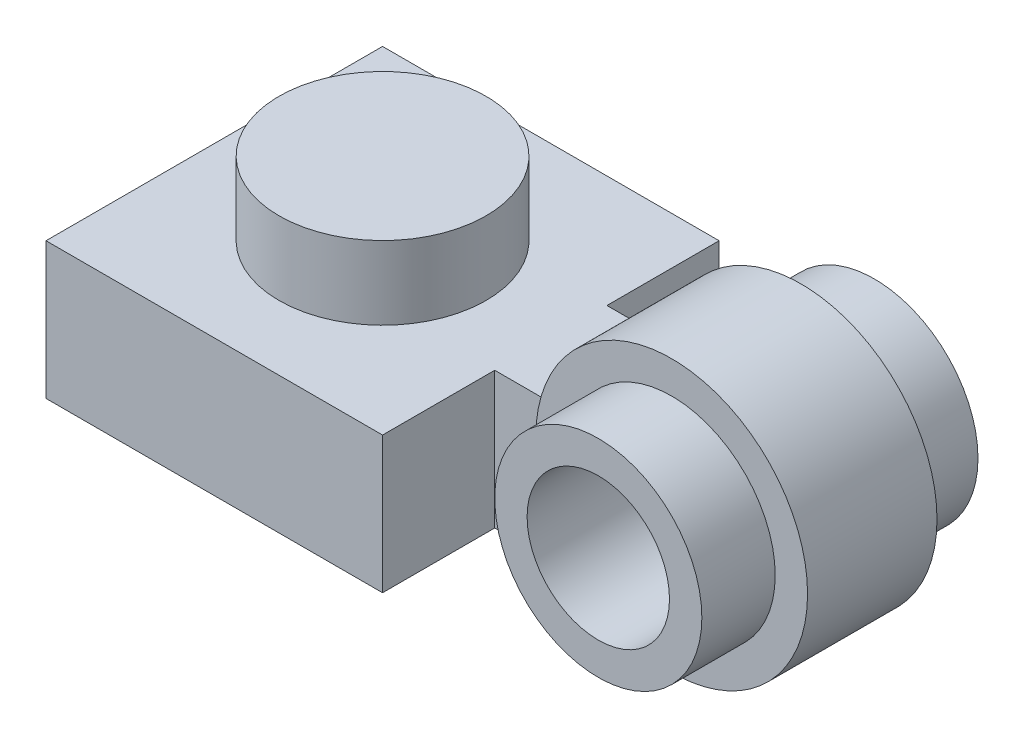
ISO-10303-21;
HEADER;
FILE_DESCRIPTION(('STEP AP214'),'2;1');
FILE_NAME('part.step','',(''),(''),'','','');
FILE_SCHEMA(('AUTOMOTIVE_DESIGN { 1 0 10303 214 1 1 1 1 }'));
ENDSEC;
DATA;
#1=APPLICATION_CONTEXT('core data for automotive mechanical design processes');
#2=APPLICATION_PROTOCOL_DEFINITION('international standard','automotive_design',2000,#1);
#3=PRODUCT_CONTEXT('',#1,'mechanical');
#4=PRODUCT('Part','Part','',(#3));
#5=PRODUCT_RELATED_PRODUCT_CATEGORY('part','',(#4));
#6=PRODUCT_DEFINITION_FORMATION('','',#4);
#7=PRODUCT_DEFINITION_CONTEXT('part definition',#1,'design');
#8=PRODUCT_DEFINITION('design','',#6,#7);
#9=PRODUCT_DEFINITION_SHAPE('','',#8);
#10=(LENGTH_UNIT() NAMED_UNIT(*) SI_UNIT(.MILLI.,.METRE.));
#11=(NAMED_UNIT(*) PLANE_ANGLE_UNIT() SI_UNIT($,.RADIAN.));
#12=(NAMED_UNIT(*) SI_UNIT($,.STERADIAN.) SOLID_ANGLE_UNIT());
#13=UNCERTAINTY_MEASURE_WITH_UNIT(LENGTH_MEASURE(1.E-05),#10,'distance_accuracy_value','');
#14=(GEOMETRIC_REPRESENTATION_CONTEXT(3) GLOBAL_UNCERTAINTY_ASSIGNED_CONTEXT((#13)) GLOBAL_UNIT_ASSIGNED_CONTEXT((#10,
#11,#12)) REPRESENTATION_CONTEXT('',''));
#15=CARTESIAN_POINT('',(0.,0.,0.));
#16=DIRECTION('',(0.,0.,1.));
#17=DIRECTION('',(1.,0.,0.));
#18=AXIS2_PLACEMENT_3D('',#15,#16,#17);
#19=CARTESIAN_POINT('',(8.2,2.5,-1.5));
#20=DIRECTION('',(0.,0.,1.));
#21=DIRECTION('',(1.,0.,0.));
#22=AXIS2_PLACEMENT_3D('',#19,#20,#21);
#23=PLANE('',#22);
#24=CARTESIAN_POINT('',(8.2,2.5,-1.5));
#25=DIRECTION('',(0.,0.,1.));
#26=DIRECTION('',(1.,0.,0.));
#27=AXIS2_PLACEMENT_3D('',#24,#25,#26);
#28=CIRCLE('',#27,3.15);
#29=CARTESIAN_POINT('',(11.35,2.5,-1.5));
#30=VERTEX_POINT('',#29);
#31=EDGE_CURVE('E508',#30,#30,#28,.T.);
#32=ORIENTED_EDGE('',*,*,#31,.F.);
#33=EDGE_LOOP('',(#32));
#34=FACE_BOUND('',#33,.T.);
#35=CARTESIAN_POINT('',(8.2,2.5,-1.5));
#36=DIRECTION('',(0.,0.,1.));
#37=DIRECTION('',(1.,0.,0.));
#38=AXIS2_PLACEMENT_3D('',#35,#36,#37);
#39=CIRCLE('',#38,2.4);
#40=CARTESIAN_POINT('',(10.6,2.5,-1.5));
#41=VERTEX_POINT('',#40);
#42=EDGE_CURVE('E11',#41,#41,#39,.F.);
#43=ORIENTED_EDGE('',*,*,#42,.F.);
#44=EDGE_LOOP('',(#43));
#45=FACE_BOUND('',#44,.T.);
#46=ADVANCED_FACE('F39',(#34,#45),#23,.F.);
#47=CARTESIAN_POINT('',(8.2,2.5,1.5));
#48=DIRECTION('',(0.,0.,1.));
#49=DIRECTION('',(1.,0.,0.));
#50=AXIS2_PLACEMENT_3D('',#47,#48,#49);
#51=PLANE('',#50);
#52=CARTESIAN_POINT('',(8.2,2.5,1.5));
#53=DIRECTION('',(0.,0.,1.));
#54=DIRECTION('',(1.,0.,0.));
#55=AXIS2_PLACEMENT_3D('',#52,#53,#54);
#56=CIRCLE('',#55,3.15);
#57=CARTESIAN_POINT('',(11.35,2.5,1.5));
#58=VERTEX_POINT('',#57);
#59=EDGE_CURVE('E511',#58,#58,#56,.T.);
#60=ORIENTED_EDGE('',*,*,#59,.T.);
#61=EDGE_LOOP('',(#60));
#62=FACE_BOUND('',#61,.T.);
#63=CARTESIAN_POINT('',(8.2,2.5,1.5));
#64=DIRECTION('',(0.,0.,1.));
#65=DIRECTION('',(1.,0.,0.));
#66=AXIS2_PLACEMENT_3D('',#63,#64,#65);
#67=CIRCLE('',#66,2.4);
#68=CARTESIAN_POINT('',(10.6,2.5,1.5));
#69=VERTEX_POINT('',#68);
#70=EDGE_CURVE('E504',#69,#69,#67,.T.);
#71=ORIENTED_EDGE('',*,*,#70,.F.);
#72=EDGE_LOOP('',(#71));
#73=FACE_BOUND('',#72,.T.);
#74=ADVANCED_FACE('F277',(#62,#73),#51,.T.);
#75=CARTESIAN_POINT('',(-3.9,3.166,-3.9));
#76=DIRECTION('',(0.,1.,0.));
#77=DIRECTION('',(0.,0.,1.));
#78=AXIS2_PLACEMENT_3D('',#75,#76,#77);
#79=PLANE('',#78);
#80=CARTESIAN_POINT('',(0.,3.166,0.));
#81=DIRECTION('',(0.,1.,0.));
#82=DIRECTION('',(0.,0.,1.));
#83=AXIS2_PLACEMENT_3D('',#80,#81,#82);
#84=CIRCLE('',#83,2.4);
#85=CARTESIAN_POINT('',(0.,3.166,2.4));
#86=VERTEX_POINT('',#85);
#87=EDGE_CURVE('E201',#86,#86,#84,.T.);
#88=ORIENTED_EDGE('',*,*,#87,.F.);
#89=EDGE_LOOP('',(#88));
#90=FACE_BOUND('',#89,.T.);
#91=DIRECTION('',(-1.,0.,0.));
#92=VECTOR('',#91,1.);
#93=CARTESIAN_POINT('',(10.7,3.166,1.3));
#94=LINE('',#93,#92);
#95=CARTESIAN_POINT('',(5.12121062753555,3.166,1.3));
#96=VERTEX_POINT('',#95);
#97=CARTESIAN_POINT('',(3.9,3.166,1.3));
#98=VERTEX_POINT('',#97);
#99=EDGE_CURVE('E137',#96,#98,#94,.T.);
#100=ORIENTED_EDGE('',*,*,#99,.F.);
#101=DIRECTION('',(0.,0.,-1.));
#102=VECTOR('',#101,1.);
#103=CARTESIAN_POINT('',(5.12121062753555,3.166,1.5));
#104=LINE('',#103,#102);
#105=CARTESIAN_POINT('',(5.12121062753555,3.166,-1.3));
#106=VERTEX_POINT('',#105);
#107=EDGE_CURVE('E140',#96,#106,#104,.T.);
#108=ORIENTED_EDGE('',*,*,#107,.T.);
#109=DIRECTION('',(-1.,0.,0.));
#110=VECTOR('',#109,1.);
#111=CARTESIAN_POINT('',(10.7,3.166,-1.3));
#112=LINE('',#111,#110);
#113=CARTESIAN_POINT('',(3.9,3.166,-1.3));
#114=VERTEX_POINT('',#113);
#115=EDGE_CURVE('E128',#106,#114,#112,.T.);
#116=ORIENTED_EDGE('',*,*,#115,.T.);
#117=DIRECTION('',(0.,0.,-1.));
#118=VECTOR('',#117,1.);
#119=CARTESIAN_POINT('',(3.9,3.166,3.9));
#120=LINE('',#119,#118);
#121=CARTESIAN_POINT('',(3.9,3.166,-3.9));
#122=VERTEX_POINT('',#121);
#123=EDGE_CURVE('E168',#114,#122,#120,.T.);
#124=ORIENTED_EDGE('',*,*,#123,.T.);
#125=DIRECTION('',(-1.,0.,0.));
#126=VECTOR('',#125,1.);
#127=CARTESIAN_POINT('',(3.9,3.166,-3.9));
#128=LINE('',#127,#126);
#129=CARTESIAN_POINT('',(-3.9,3.166,-3.9));
#130=VERTEX_POINT('',#129);
#131=EDGE_CURVE('E221',#122,#130,#128,.T.);
#132=ORIENTED_EDGE('',*,*,#131,.T.);
#133=DIRECTION('',(0.,0.,1.));
#134=VECTOR('',#133,1.);
#135=CARTESIAN_POINT('',(-3.9,3.166,3.9));
#136=LINE('',#135,#134);
#137=CARTESIAN_POINT('',(-3.9,3.166,3.9));
#138=VERTEX_POINT('',#137);
#139=EDGE_CURVE('E214',#130,#138,#136,.T.);
#140=ORIENTED_EDGE('',*,*,#139,.T.);
#141=DIRECTION('',(1.,0.,0.));
#142=VECTOR('',#141,1.);
#143=CARTESIAN_POINT('',(3.9,3.166,3.9));
#144=LINE('',#143,#142);
#145=CARTESIAN_POINT('',(3.9,3.166,3.9));
#146=VERTEX_POINT('',#145);
#147=EDGE_CURVE('E217',#138,#146,#144,.T.);
#148=ORIENTED_EDGE('',*,*,#147,.T.);
#149=EDGE_CURVE('E224',#146,#98,#120,.T.);
#150=ORIENTED_EDGE('',*,*,#149,.T.);
#151=EDGE_LOOP('',(#100,#108,#116,#124,#132,#140,#148,#150));
#152=FACE_BOUND('',#151,.T.);
#153=ADVANCED_FACE('F141',(#90,#152),#79,.T.);
#154=CARTESIAN_POINT('',(-3.9,0.,-3.9));
#155=DIRECTION('',(0.,1.,0.));
#156=DIRECTION('',(0.,0.,1.));
#157=AXIS2_PLACEMENT_3D('',#154,#155,#156);
#158=PLANE('',#157);
#159=DIRECTION('',(1.,0.,0.));
#160=VECTOR('',#159,1.);
#161=CARTESIAN_POINT('',(2.45,0.,-2.45));
#162=LINE('',#161,#160);
#163=CARTESIAN_POINT('',(-2.45,0.,-2.45));
#164=VERTEX_POINT('',#163);
#165=CARTESIAN_POINT('',(2.45,0.,-2.45));
#166=VERTEX_POINT('',#165);
#167=EDGE_CURVE('E191',#164,#166,#162,.T.);
#168=ORIENTED_EDGE('',*,*,#167,.F.);
#169=DIRECTION('',(0.,0.,-1.));
#170=VECTOR('',#169,1.);
#171=CARTESIAN_POINT('',(-2.45,0.,-2.45));
#172=LINE('',#171,#170);
#173=CARTESIAN_POINT('',(-2.45,0.,2.45));
#174=VERTEX_POINT('',#173);
#175=EDGE_CURVE('E189',#174,#164,#172,.T.);
#176=ORIENTED_EDGE('',*,*,#175,.F.);
#177=DIRECTION('',(-1.,0.,0.));
#178=VECTOR('',#177,1.);
#179=CARTESIAN_POINT('',(2.45,0.,2.45));
#180=LINE('',#179,#178);
#181=CARTESIAN_POINT('',(2.45,0.,2.45));
#182=VERTEX_POINT('',#181);
#183=EDGE_CURVE('E179',#182,#174,#180,.T.);
#184=ORIENTED_EDGE('',*,*,#183,.F.);
#185=DIRECTION('',(0.,0.,1.));
#186=VECTOR('',#185,1.);
#187=CARTESIAN_POINT('',(2.45,0.,-2.45));
#188=LINE('',#187,#186);
#189=EDGE_CURVE('E194',#166,#182,#188,.T.);
#190=ORIENTED_EDGE('',*,*,#189,.F.);
#191=EDGE_LOOP('',(#168,#176,#184,#190));
#192=FACE_BOUND('',#191,.T.);
#193=DIRECTION('',(0.,0.,-1.));
#194=VECTOR('',#193,1.);
#195=CARTESIAN_POINT('',(6.28362321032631,0.,1.5));
#196=LINE('',#195,#194);
#197=CARTESIAN_POINT('',(6.28362321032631,0.,1.3));
#198=VERTEX_POINT('',#197);
#199=CARTESIAN_POINT('',(6.28362321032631,0.,-1.3));
#200=VERTEX_POINT('',#199);
#201=EDGE_CURVE('E54',#198,#200,#196,.T.);
#202=ORIENTED_EDGE('',*,*,#201,.F.);
#203=DIRECTION('',(-1.,0.,0.));
#204=VECTOR('',#203,1.);
#205=CARTESIAN_POINT('',(10.7,0.,1.3));
#206=LINE('',#205,#204);
#207=CARTESIAN_POINT('',(3.9,0.,1.3));
#208=VERTEX_POINT('',#207);
#209=EDGE_CURVE('E155',#198,#208,#206,.T.);
#210=ORIENTED_EDGE('',*,*,#209,.T.);
#211=DIRECTION('',(0.,0.,-1.));
#212=VECTOR('',#211,1.);
#213=CARTESIAN_POINT('',(3.9,0.,3.9));
#214=LINE('',#213,#212);
#215=CARTESIAN_POINT('',(3.9,0.,3.9));
#216=VERTEX_POINT('',#215);
#217=EDGE_CURVE('E229',#216,#208,#214,.T.);
#218=ORIENTED_EDGE('',*,*,#217,.F.);
#219=DIRECTION('',(1.,0.,0.));
#220=VECTOR('',#219,1.);
#221=CARTESIAN_POINT('',(3.9,0.,3.9));
#222=LINE('',#221,#220);
#223=CARTESIAN_POINT('',(-3.9,0.,3.9));
#224=VERTEX_POINT('',#223);
#225=EDGE_CURVE('E230',#224,#216,#222,.T.);
#226=ORIENTED_EDGE('',*,*,#225,.F.);
#227=DIRECTION('',(0.,0.,1.));
#228=VECTOR('',#227,1.);
#229=CARTESIAN_POINT('',(-3.9,0.,3.9));
#230=LINE('',#229,#228);
#231=CARTESIAN_POINT('',(-3.9,0.,-3.9));
#232=VERTEX_POINT('',#231);
#233=EDGE_CURVE('E211',#232,#224,#230,.T.);
#234=ORIENTED_EDGE('',*,*,#233,.F.);
#235=DIRECTION('',(-1.,0.,0.));
#236=VECTOR('',#235,1.);
#237=CARTESIAN_POINT('',(3.9,0.,-3.9));
#238=LINE('',#237,#236);
#239=CARTESIAN_POINT('',(3.9,0.,-3.9));
#240=VERTEX_POINT('',#239);
#241=EDGE_CURVE('E218',#240,#232,#238,.T.);
#242=ORIENTED_EDGE('',*,*,#241,.F.);
#243=CARTESIAN_POINT('',(3.9,0.,-1.3));
#244=VERTEX_POINT('',#243);
#245=EDGE_CURVE('E226',#244,#240,#214,.T.);
#246=ORIENTED_EDGE('',*,*,#245,.F.);
#247=DIRECTION('',(-1.,0.,0.));
#248=VECTOR('',#247,1.);
#249=CARTESIAN_POINT('',(10.7,0.,-1.3));
#250=LINE('',#249,#248);
#251=EDGE_CURVE('E136',#200,#244,#250,.T.);
#252=ORIENTED_EDGE('',*,*,#251,.F.);
#253=EDGE_LOOP('',(#202,#210,#218,#226,#234,#242,#246,#252));
#254=FACE_BOUND('',#253,.T.);
#255=ADVANCED_FACE('F252',(#192,#254),#158,.F.);
#256=CARTESIAN_POINT('',(10.7,0.,1.3));
#257=DIRECTION('',(0.,0.,-1.));
#258=DIRECTION('',(-1.,0.,0.));
#259=AXIS2_PLACEMENT_3D('',#256,#257,#258);
#260=PLANE('',#259);
#261=CARTESIAN_POINT('',(8.2,2.5,1.3));
#262=DIRECTION('',(0.,0.,-1.));
#263=DIRECTION('',(-1.,0.,0.));
#264=AXIS2_PLACEMENT_3D('',#261,#262,#263);
#265=CIRCLE('',#264,3.15);
#266=EDGE_CURVE('E61',#96,#198,#265,.F.);
#267=ORIENTED_EDGE('',*,*,#266,.F.);
#268=ORIENTED_EDGE('',*,*,#99,.T.);
#269=DIRECTION('',(0.,-1.,0.));
#270=VECTOR('',#269,1.);
#271=CARTESIAN_POINT('',(3.9,0.,1.3));
#272=LINE('',#271,#270);
#273=EDGE_CURVE('E159',#98,#208,#272,.T.);
#274=ORIENTED_EDGE('',*,*,#273,.T.);
#275=ORIENTED_EDGE('',*,*,#209,.F.);
#276=EDGE_LOOP('',(#267,#268,#274,#275));
#277=FACE_BOUND('',#276,.T.);
#278=ADVANCED_FACE('F296',(#277),#260,.F.);
#279=CARTESIAN_POINT('',(10.7,3.166,-1.3));
#280=DIRECTION('',(0.,0.,1.));
#281=DIRECTION('',(0.,-1.,0.));
#282=AXIS2_PLACEMENT_3D('',#279,#280,#281);
#283=PLANE('',#282);
#284=CARTESIAN_POINT('',(8.2,2.5,-1.3));
#285=DIRECTION('',(0.,0.,1.));
#286=DIRECTION('',(0.,-1.,0.));
#287=AXIS2_PLACEMENT_3D('',#284,#285,#286);
#288=CIRCLE('',#287,3.15);
#289=EDGE_CURVE('E47',#200,#106,#288,.F.);
#290=ORIENTED_EDGE('',*,*,#289,.F.);
#291=ORIENTED_EDGE('',*,*,#251,.T.);
#292=DIRECTION('',(0.,1.,0.));
#293=VECTOR('',#292,1.);
#294=CARTESIAN_POINT('',(3.9,3.166,-1.3));
#295=LINE('',#294,#293);
#296=EDGE_CURVE('E133',#244,#114,#295,.T.);
#297=ORIENTED_EDGE('',*,*,#296,.T.);
#298=ORIENTED_EDGE('',*,*,#115,.F.);
#299=EDGE_LOOP('',(#290,#291,#297,#298));
#300=FACE_BOUND('',#299,.T.);
#301=ADVANCED_FACE('F130',(#300),#283,.F.);
#302=CARTESIAN_POINT('',(3.9,3.166,3.9));
#303=DIRECTION('',(-1.,0.,0.));
#304=DIRECTION('',(0.,0.,1.));
#305=AXIS2_PLACEMENT_3D('',#302,#303,#304);
#306=PLANE('',#305);
#307=ORIENTED_EDGE('',*,*,#273,.F.);
#308=ORIENTED_EDGE('',*,*,#149,.F.);
#309=DIRECTION('',(0.,-1.,0.));
#310=VECTOR('',#309,1.);
#311=CARTESIAN_POINT('',(3.9,3.166,3.9));
#312=LINE('',#311,#310);
#313=EDGE_CURVE('E149',#146,#216,#312,.T.);
#314=ORIENTED_EDGE('',*,*,#313,.T.);
#315=ORIENTED_EDGE('',*,*,#217,.T.);
#316=EDGE_LOOP('',(#307,#308,#314,#315));
#317=FACE_BOUND('',#316,.T.);
#318=ADVANCED_FACE('F249',(#317),#306,.F.);
#319=ORIENTED_EDGE('',*,*,#296,.F.);
#320=ORIENTED_EDGE('',*,*,#245,.T.);
#321=DIRECTION('',(0.,-1.,0.));
#322=VECTOR('',#321,1.);
#323=CARTESIAN_POINT('',(3.9,3.166,-3.9));
#324=LINE('',#323,#322);
#325=EDGE_CURVE('E239',#122,#240,#324,.T.);
#326=ORIENTED_EDGE('',*,*,#325,.F.);
#327=ORIENTED_EDGE('',*,*,#123,.F.);
#328=EDGE_LOOP('',(#319,#320,#326,#327));
#329=FACE_BOUND('',#328,.T.);
#330=ADVANCED_FACE('F256',(#329),#306,.F.);
#331=CARTESIAN_POINT('',(-3.9,3.166,3.9));
#332=DIRECTION('',(1.,0.,0.));
#333=DIRECTION('',(0.,0.,-1.));
#334=AXIS2_PLACEMENT_3D('',#331,#332,#333);
#335=PLANE('',#334);
#336=ORIENTED_EDGE('',*,*,#233,.T.);
#337=DIRECTION('',(0.,-1.,0.));
#338=VECTOR('',#337,1.);
#339=CARTESIAN_POINT('',(-3.9,3.166,3.9));
#340=LINE('',#339,#338);
#341=EDGE_CURVE('E146',#138,#224,#340,.T.);
#342=ORIENTED_EDGE('',*,*,#341,.F.);
#343=ORIENTED_EDGE('',*,*,#139,.F.);
#344=DIRECTION('',(0.,-1.,0.));
#345=VECTOR('',#344,1.);
#346=CARTESIAN_POINT('',(-3.9,3.166,-3.9));
#347=LINE('',#346,#345);
#348=EDGE_CURVE('E236',#130,#232,#347,.T.);
#349=ORIENTED_EDGE('',*,*,#348,.T.);
#350=EDGE_LOOP('',(#336,#342,#343,#349));
#351=FACE_BOUND('',#350,.T.);
#352=ADVANCED_FACE('F41',(#351),#335,.F.);
#353=CARTESIAN_POINT('',(3.9,3.166,3.9));
#354=DIRECTION('',(0.,0.,-1.));
#355=DIRECTION('',(-1.,0.,0.));
#356=AXIS2_PLACEMENT_3D('',#353,#354,#355);
#357=PLANE('',#356);
#358=ORIENTED_EDGE('',*,*,#225,.T.);
#359=ORIENTED_EDGE('',*,*,#313,.F.);
#360=ORIENTED_EDGE('',*,*,#147,.F.);
#361=ORIENTED_EDGE('',*,*,#341,.T.);
#362=EDGE_LOOP('',(#358,#359,#360,#361));
#363=FACE_BOUND('',#362,.T.);
#364=ADVANCED_FACE('F267',(#363),#357,.F.);
#365=CARTESIAN_POINT('',(3.9,3.166,-3.9));
#366=DIRECTION('',(0.,0.,1.));
#367=DIRECTION('',(1.,0.,0.));
#368=AXIS2_PLACEMENT_3D('',#365,#366,#367);
#369=PLANE('',#368);
#370=ORIENTED_EDGE('',*,*,#241,.T.);
#371=ORIENTED_EDGE('',*,*,#348,.F.);
#372=ORIENTED_EDGE('',*,*,#131,.F.);
#373=ORIENTED_EDGE('',*,*,#325,.T.);
#374=EDGE_LOOP('',(#370,#371,#372,#373));
#375=FACE_BOUND('',#374,.T.);
#376=ADVANCED_FACE('F262',(#375),#369,.F.);
#377=CARTESIAN_POINT('',(0.,4.866,0.));
#378=DIRECTION('',(0.,-1.,0.));
#379=DIRECTION('',(0.,0.,-1.));
#380=AXIS2_PLACEMENT_3D('',#377,#378,#379);
#381=CYLINDRICAL_SURFACE('',#380,2.4);
#382=CARTESIAN_POINT('',(0.,4.866,0.));
#383=DIRECTION('',(0.,1.,0.));
#384=DIRECTION('',(0.,0.,1.));
#385=AXIS2_PLACEMENT_3D('',#382,#383,#384);
#386=CIRCLE('',#385,2.4);
#387=CARTESIAN_POINT('',(0.,4.866,2.4));
#388=VERTEX_POINT('',#387);
#389=EDGE_CURVE('E208',#388,#388,#386,.T.);
#390=ORIENTED_EDGE('',*,*,#389,.F.);
#391=EDGE_LOOP('',(#390));
#392=FACE_BOUND('',#391,.T.);
#393=ORIENTED_EDGE('',*,*,#87,.T.);
#394=EDGE_LOOP('',(#393));
#395=FACE_BOUND('',#394,.T.);
#396=ADVANCED_FACE('F273',(#392,#395),#381,.T.);
#397=CARTESIAN_POINT('',(0.,4.866,0.));
#398=DIRECTION('',(0.,1.,0.));
#399=DIRECTION('',(0.,0.,1.));
#400=AXIS2_PLACEMENT_3D('',#397,#398,#399);
#401=PLANE('',#400);
#402=ORIENTED_EDGE('',*,*,#389,.T.);
#403=EDGE_LOOP('',(#402));
#404=FACE_BOUND('',#403,.T.);
#405=ADVANCED_FACE('F317',(#404),#401,.T.);
#406=CARTESIAN_POINT('',(-2.45,2.5,-2.45));
#407=DIRECTION('',(-1.,0.,0.));
#408=DIRECTION('',(0.,0.,1.));
#409=AXIS2_PLACEMENT_3D('',#406,#407,#408);
#410=PLANE('',#409);
#411=ORIENTED_EDGE('',*,*,#175,.T.);
#412=DIRECTION('',(0.,-1.,0.));
#413=VECTOR('',#412,1.);
#414=CARTESIAN_POINT('',(-2.45,2.5,-2.45));
#415=LINE('',#414,#413);
#416=CARTESIAN_POINT('',(-2.45,2.5,-2.45));
#417=VERTEX_POINT('',#416);
#418=EDGE_CURVE('E188',#417,#164,#415,.T.);
#419=ORIENTED_EDGE('',*,*,#418,.F.);
#420=DIRECTION('',(0.,0.,-1.));
#421=VECTOR('',#420,1.);
#422=CARTESIAN_POINT('',(-2.45,2.5,-2.45));
#423=LINE('',#422,#421);
#424=CARTESIAN_POINT('',(-2.45,2.5,2.45));
#425=VERTEX_POINT('',#424);
#426=EDGE_CURVE('E175',#425,#417,#423,.T.);
#427=ORIENTED_EDGE('',*,*,#426,.F.);
#428=DIRECTION('',(0.,-1.,0.));
#429=VECTOR('',#428,1.);
#430=CARTESIAN_POINT('',(-2.45,2.5,2.45));
#431=LINE('',#430,#429);
#432=EDGE_CURVE('E199',#425,#174,#431,.T.);
#433=ORIENTED_EDGE('',*,*,#432,.T.);
#434=EDGE_LOOP('',(#411,#419,#427,#433));
#435=FACE_BOUND('',#434,.T.);
#436=ADVANCED_FACE('F307',(#435),#410,.F.);
#437=CARTESIAN_POINT('',(2.45,2.5,2.45));
#438=DIRECTION('',(0.,0.,1.));
#439=DIRECTION('',(1.,0.,0.));
#440=AXIS2_PLACEMENT_3D('',#437,#438,#439);
#441=PLANE('',#440);
#442=ORIENTED_EDGE('',*,*,#183,.T.);
#443=ORIENTED_EDGE('',*,*,#432,.F.);
#444=DIRECTION('',(-1.,0.,0.));
#445=VECTOR('',#444,1.);
#446=CARTESIAN_POINT('',(2.45,2.5,2.45));
#447=LINE('',#446,#445);
#448=CARTESIAN_POINT('',(2.45,2.5,2.45));
#449=VERTEX_POINT('',#448);
#450=EDGE_CURVE('E185',#449,#425,#447,.T.);
#451=ORIENTED_EDGE('',*,*,#450,.F.);
#452=DIRECTION('',(0.,-1.,0.));
#453=VECTOR('',#452,1.);
#454=CARTESIAN_POINT('',(2.45,2.5,2.45));
#455=LINE('',#454,#453);
#456=EDGE_CURVE('E202',#449,#182,#455,.T.);
#457=ORIENTED_EDGE('',*,*,#456,.T.);
#458=EDGE_LOOP('',(#442,#443,#451,#457));
#459=FACE_BOUND('',#458,.T.);
#460=ADVANCED_FACE('F303',(#459),#441,.F.);
#461=CARTESIAN_POINT('',(2.45,2.5,-2.45));
#462=DIRECTION('',(1.,0.,0.));
#463=DIRECTION('',(0.,0.,-1.));
#464=AXIS2_PLACEMENT_3D('',#461,#462,#463);
#465=PLANE('',#464);
#466=ORIENTED_EDGE('',*,*,#189,.T.);
#467=ORIENTED_EDGE('',*,*,#456,.F.);
#468=DIRECTION('',(0.,0.,1.));
#469=VECTOR('',#468,1.);
#470=CARTESIAN_POINT('',(2.45,2.5,-2.45));
#471=LINE('',#470,#469);
#472=CARTESIAN_POINT('',(2.45,2.5,-2.45));
#473=VERTEX_POINT('',#472);
#474=EDGE_CURVE('E182',#473,#449,#471,.T.);
#475=ORIENTED_EDGE('',*,*,#474,.F.);
#476=DIRECTION('',(0.,-1.,0.));
#477=VECTOR('',#476,1.);
#478=CARTESIAN_POINT('',(2.45,2.5,-2.45));
#479=LINE('',#478,#477);
#480=EDGE_CURVE('E204',#473,#166,#479,.T.);
#481=ORIENTED_EDGE('',*,*,#480,.T.);
#482=EDGE_LOOP('',(#466,#467,#475,#481));
#483=FACE_BOUND('',#482,.T.);
#484=ADVANCED_FACE('F306',(#483),#465,.F.);
#485=CARTESIAN_POINT('',(2.45,2.5,-2.45));
#486=DIRECTION('',(0.,0.,-1.));
#487=DIRECTION('',(-1.,0.,0.));
#488=AXIS2_PLACEMENT_3D('',#485,#486,#487);
#489=PLANE('',#488);
#490=ORIENTED_EDGE('',*,*,#167,.T.);
#491=ORIENTED_EDGE('',*,*,#480,.F.);
#492=DIRECTION('',(1.,0.,0.));
#493=VECTOR('',#492,1.);
#494=CARTESIAN_POINT('',(2.45,2.5,-2.45));
#495=LINE('',#494,#493);
#496=EDGE_CURVE('E178',#417,#473,#495,.T.);
#497=ORIENTED_EDGE('',*,*,#496,.F.);
#498=ORIENTED_EDGE('',*,*,#418,.T.);
#499=EDGE_LOOP('',(#490,#491,#497,#498));
#500=FACE_BOUND('',#499,.T.);
#501=ADVANCED_FACE('F301',(#500),#489,.F.);
#502=CARTESIAN_POINT('',(-2.45,2.5,2.45));
#503=DIRECTION('',(0.,-1.,0.));
#504=DIRECTION('',(0.,0.,-1.));
#505=AXIS2_PLACEMENT_3D('',#502,#503,#504);
#506=PLANE('',#505);
#507=ORIENTED_EDGE('',*,*,#426,.T.);
#508=ORIENTED_EDGE('',*,*,#496,.T.);
#509=ORIENTED_EDGE('',*,*,#474,.T.);
#510=ORIENTED_EDGE('',*,*,#450,.T.);
#511=EDGE_LOOP('',(#507,#508,#509,#510));
#512=FACE_BOUND('',#511,.T.);
#513=ADVANCED_FACE('F292',(#512),#506,.T.);
#514=CARTESIAN_POINT('',(8.2,2.5,1.5));
#515=DIRECTION('',(0.,0.,-1.));
#516=DIRECTION('',(-1.,0.,0.));
#517=AXIS2_PLACEMENT_3D('',#514,#515,#516);
#518=CYLINDRICAL_SURFACE('',#517,3.15);
#519=ORIENTED_EDGE('',*,*,#31,.T.);
#520=EDGE_LOOP('',(#519));
#521=FACE_BOUND('',#520,.T.);
#522=ORIENTED_EDGE('',*,*,#59,.F.);
#523=EDGE_LOOP('',(#522));
#524=FACE_BOUND('',#523,.T.);
#525=ORIENTED_EDGE('',*,*,#107,.F.);
#526=ORIENTED_EDGE('',*,*,#266,.T.);
#527=ORIENTED_EDGE('',*,*,#201,.T.);
#528=ORIENTED_EDGE('',*,*,#289,.T.);
#529=EDGE_LOOP('',(#525,#526,#527,#528));
#530=FACE_BOUND('',#529,.T.);
#531=ADVANCED_FACE('F145',(#521,#524,#530),#518,.T.);
#532=CARTESIAN_POINT('',(8.2,2.5,3.2));
#533=DIRECTION('',(0.,0.,-1.));
#534=DIRECTION('',(-1.,0.,0.));
#535=AXIS2_PLACEMENT_3D('',#532,#533,#534);
#536=CYLINDRICAL_SURFACE('',#535,2.4);
#537=CARTESIAN_POINT('',(8.2,2.5,3.2));
#538=DIRECTION('',(0.,0.,1.));
#539=DIRECTION('',(1.,0.,0.));
#540=AXIS2_PLACEMENT_3D('',#537,#538,#539);
#541=CIRCLE('',#540,2.4);
#542=CARTESIAN_POINT('',(10.6,2.5,3.2));
#543=VERTEX_POINT('',#542);
#544=EDGE_CURVE('E505',#543,#543,#541,.T.);
#545=ORIENTED_EDGE('',*,*,#544,.F.);
#546=EDGE_LOOP('',(#545));
#547=FACE_BOUND('',#546,.T.);
#548=ORIENTED_EDGE('',*,*,#70,.T.);
#549=EDGE_LOOP('',(#548));
#550=FACE_BOUND('',#549,.T.);
#551=ADVANCED_FACE('F291',(#547,#550),#536,.T.);
#552=CARTESIAN_POINT('',(8.2,2.5,3.2));
#553=DIRECTION('',(0.,0.,1.));
#554=DIRECTION('',(1.,0.,0.));
#555=AXIS2_PLACEMENT_3D('',#552,#553,#554);
#556=PLANE('',#555);
#557=CARTESIAN_POINT('',(8.2,2.5,3.2));
#558=DIRECTION('',(0.,0.,1.));
#559=DIRECTION('',(1.,0.,0.));
#560=AXIS2_PLACEMENT_3D('',#557,#558,#559);
#561=CIRCLE('',#560,1.65);
#562=CARTESIAN_POINT('',(9.85,2.5,3.2));
#563=VERTEX_POINT('',#562);
#564=EDGE_CURVE('E494',#563,#563,#561,.T.);
#565=ORIENTED_EDGE('',*,*,#564,.F.);
#566=EDGE_LOOP('',(#565));
#567=FACE_BOUND('',#566,.T.);
#568=ORIENTED_EDGE('',*,*,#544,.T.);
#569=EDGE_LOOP('',(#568));
#570=FACE_BOUND('',#569,.T.);
#571=ADVANCED_FACE('F444',(#567,#570),#556,.T.);
#572=CARTESIAN_POINT('',(8.2,2.5,-3.2));
#573=DIRECTION('',(0.,0.,1.));
#574=DIRECTION('',(1.,0.,0.));
#575=AXIS2_PLACEMENT_3D('',#572,#573,#574);
#576=CYLINDRICAL_SURFACE('',#575,2.4);
#577=CARTESIAN_POINT('',(8.2,2.5,-3.2));
#578=DIRECTION('',(0.,0.,-1.));
#579=DIRECTION('',(-1.,0.,0.));
#580=AXIS2_PLACEMENT_3D('',#577,#578,#579);
#581=CIRCLE('',#580,2.4);
#582=CARTESIAN_POINT('',(5.8,2.5,-3.2));
#583=VERTEX_POINT('',#582);
#584=EDGE_CURVE('E499',#583,#583,#581,.T.);
#585=ORIENTED_EDGE('',*,*,#584,.F.);
#586=EDGE_LOOP('',(#585));
#587=FACE_BOUND('',#586,.T.);
#588=ORIENTED_EDGE('',*,*,#42,.T.);
#589=EDGE_LOOP('',(#588));
#590=FACE_BOUND('',#589,.T.);
#591=ADVANCED_FACE('F452',(#587,#590),#576,.T.);
#592=CARTESIAN_POINT('',(8.2,2.5,-3.2));
#593=DIRECTION('',(0.,0.,-1.));
#594=DIRECTION('',(-1.,0.,0.));
#595=AXIS2_PLACEMENT_3D('',#592,#593,#594);
#596=PLANE('',#595);
#597=CARTESIAN_POINT('',(8.2,2.5,-3.2));
#598=DIRECTION('',(0.,0.,-1.));
#599=DIRECTION('',(-1.,0.,0.));
#600=AXIS2_PLACEMENT_3D('',#597,#598,#599);
#601=CIRCLE('',#600,1.65);
#602=CARTESIAN_POINT('',(6.55,2.5,-3.2));
#603=VERTEX_POINT('',#602);
#604=EDGE_CURVE('E497',#603,#603,#601,.T.);
#605=ORIENTED_EDGE('',*,*,#604,.F.);
#606=EDGE_LOOP('',(#605));
#607=FACE_BOUND('',#606,.T.);
#608=ORIENTED_EDGE('',*,*,#584,.T.);
#609=EDGE_LOOP('',(#608));
#610=FACE_BOUND('',#609,.T.);
#611=ADVANCED_FACE('F466',(#607,#610),#596,.T.);
#612=CARTESIAN_POINT('',(8.2,2.5,3.900025));
#613=DIRECTION('',(0.,0.,-1.));
#614=DIRECTION('',(-1.,0.,0.));
#615=AXIS2_PLACEMENT_3D('',#612,#613,#614);
#616=CYLINDRICAL_SURFACE('',#615,1.65);
#617=ORIENTED_EDGE('',*,*,#564,.T.);
#618=EDGE_LOOP('',(#617));
#619=FACE_BOUND('',#618,.T.);
#620=ORIENTED_EDGE('',*,*,#604,.T.);
#621=EDGE_LOOP('',(#620));
#622=FACE_BOUND('',#621,.T.);
#623=ADVANCED_FACE('F474',(#619,#622),#616,.F.);
#624=CLOSED_SHELL('',(#46,#74,#153,#255,#278,#301,#318,#330,#352,#364,#376,#396,#405,#436,#460,
#484,#501,#513,#531,#551,#571,#591,#611,#623));
#625=MANIFOLD_SOLID_BREP('B2',#624);
#626=ADVANCED_BREP_SHAPE_REPRESENTATION('',(#18,#625),#14);
#627=SHAPE_DEFINITION_REPRESENTATION(#9,#626);
ENDSEC;
END-ISO-10303-21;
